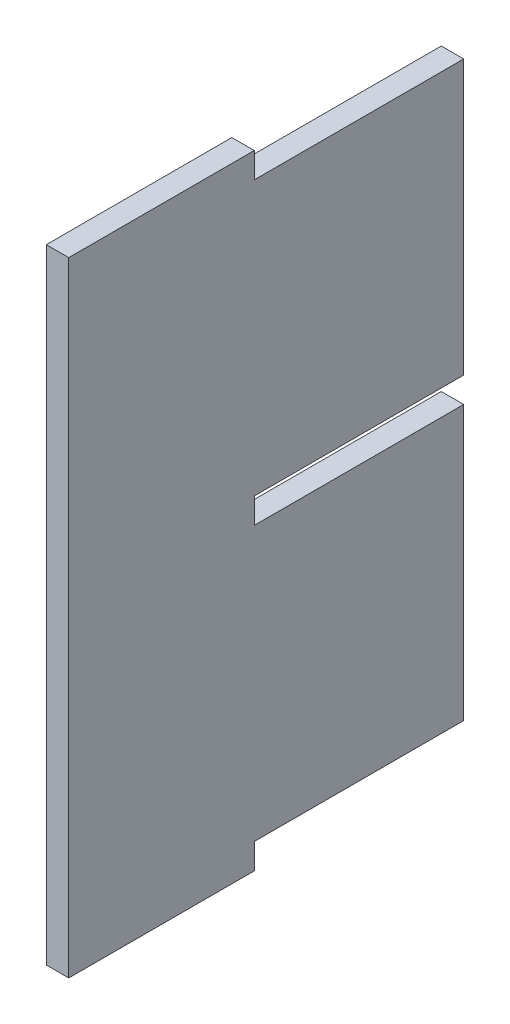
from build123d import *

# Parameters (mm, degrees)
CROQUIS16_W             = 1.5
CROQUIS16_H             = 79.5
SALIENTE_EXTRUIR9_DEPTH = 26.4
CROQUIS20_W             = 14
CROQUIS20_H             = 1.7
CORTAR_EXTRUIR2_DEPTH   = 1.5
CROQUIS21_W             = 26.4
CROQUIS21_H             = 18.9
CORTAR_EXTRUIR3_DEPTH   = 1.5


with BuildPart() as part:
    # Croquis16 → Saliente-Extruir9 (new body)
    with BuildSketch(Plane.XY):
        with Locations((-17.5, 0)):
            Rectangle(CROQUIS16_W, CROQUIS16_H)
    extrude(amount=SALIENTE_EXTRUIR9_DEPTH)

    # Croquis20 → Cortar-Extruir2 (cut)
    with BuildSketch(Plane(origin=(-16.75, 0, 0), x_dir=(0, 0, -1), z_dir=(1, 0, 0))):
        with Locations((-7, -20)):
            Rectangle(CROQUIS20_W, CROQUIS20_H)
        with Locations((-7, 0)):
            Rectangle(CROQUIS20_W, CROQUIS20_H)
        with Locations((-7, 20)):
            Rectangle(CROQUIS20_W, CROQUIS20_H)
    extrude(amount=-CORTAR_EXTRUIR2_DEPTH, mode=Mode.SUBTRACT)

    # Croquis21 → Cortar-Extruir3 (cut)
    with BuildSketch(Plane(origin=(-16.75, 0, 0), x_dir=(0, 0, -1), z_dir=(1, 0, 0))):
        with Locations((-13.2, -30.3)):
            Rectangle(CROQUIS21_W, CROQUIS21_H)
        with Locations((-13.2, 30.3)):
            Rectangle(CROQUIS21_W, CROQUIS21_H)
    extrude(amount=-CORTAR_EXTRUIR3_DEPTH, mode=Mode.SUBTRACT)


solid = part.part
